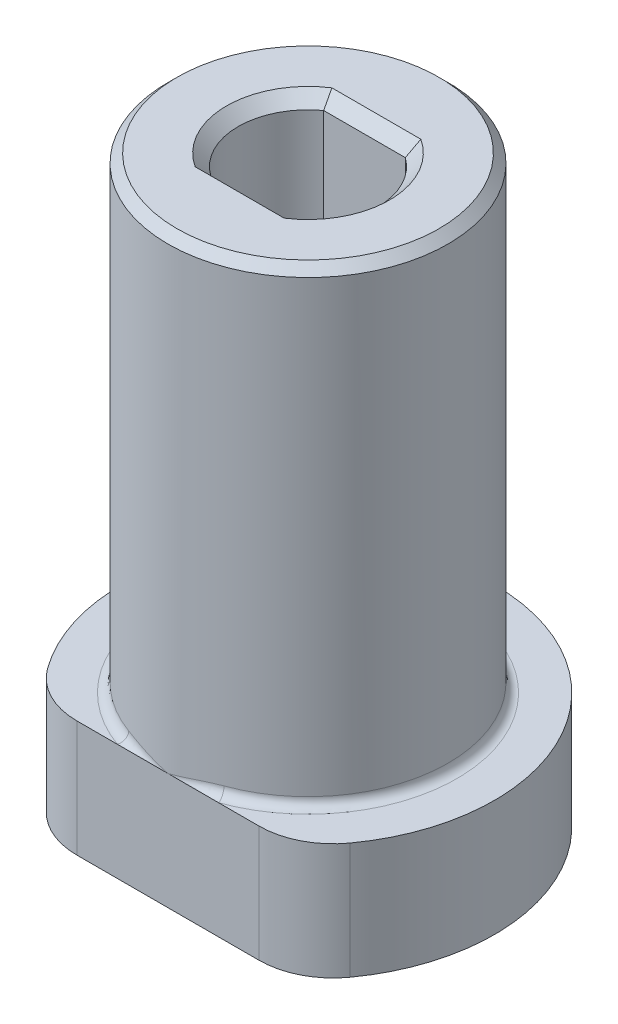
ISO-10303-21;
HEADER;
FILE_DESCRIPTION(('STEP AP214'),'2;1');
FILE_NAME('part.step','',(''),(''),'','','');
FILE_SCHEMA(('AUTOMOTIVE_DESIGN { 1 0 10303 214 1 1 1 1 }'));
ENDSEC;
DATA;
#1=APPLICATION_CONTEXT('core data for automotive mechanical design processes');
#2=APPLICATION_PROTOCOL_DEFINITION('international standard','automotive_design',2000,#1);
#3=PRODUCT_CONTEXT('',#1,'mechanical');
#4=PRODUCT('Part','Part','',(#3));
#5=PRODUCT_RELATED_PRODUCT_CATEGORY('part','',(#4));
#6=PRODUCT_DEFINITION_FORMATION('','',#4);
#7=PRODUCT_DEFINITION_CONTEXT('part definition',#1,'design');
#8=PRODUCT_DEFINITION('design','',#6,#7);
#9=PRODUCT_DEFINITION_SHAPE('','',#8);
#10=(LENGTH_UNIT() NAMED_UNIT(*) SI_UNIT(.MILLI.,.METRE.));
#11=(NAMED_UNIT(*) PLANE_ANGLE_UNIT() SI_UNIT($,.RADIAN.));
#12=(NAMED_UNIT(*) SI_UNIT($,.STERADIAN.) SOLID_ANGLE_UNIT());
#13=UNCERTAINTY_MEASURE_WITH_UNIT(LENGTH_MEASURE(1.E-05),#10,'distance_accuracy_value','');
#14=(GEOMETRIC_REPRESENTATION_CONTEXT(3) GLOBAL_UNCERTAINTY_ASSIGNED_CONTEXT((#13)) GLOBAL_UNIT_ASSIGNED_CONTEXT((#10,
#11,#12)) REPRESENTATION_CONTEXT('',''));
#15=CARTESIAN_POINT('',(0.,0.,0.));
#16=DIRECTION('',(0.,0.,1.));
#17=DIRECTION('',(1.,0.,0.));
#18=AXIS2_PLACEMENT_3D('',#15,#16,#17);
#19=CARTESIAN_POINT('',(0.,24.9936,0.));
#20=DIRECTION('',(0.,-1.,0.));
#21=DIRECTION('',(0.,0.,-1.));
#22=AXIS2_PLACEMENT_3D('',#19,#20,#21);
#23=CYLINDRICAL_SURFACE('',#22,5.99567);
#24=CARTESIAN_POINT('',(0.,24.6126,0.));
#25=DIRECTION('',(0.,1.,0.));
#26=DIRECTION('',(0.,0.,1.));
#27=AXIS2_PLACEMENT_3D('',#24,#25,#26);
#28=CIRCLE('',#27,5.99567);
#29=CARTESIAN_POINT('',(0.,24.6126,5.99567));
#30=VERTEX_POINT('',#29);
#31=EDGE_CURVE('E12',#30,#30,#28,.F.);
#32=ORIENTED_EDGE('',*,*,#31,.T.);
#33=EDGE_LOOP('',(#32));
#34=FACE_BOUND('',#33,.T.);
#35=CARTESIAN_POINT('',(-2.54980318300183,5.28632587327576,5.42646869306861));
#36=CARTESIAN_POINT('',(-2.48955629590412,5.07151106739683,5.4547776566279));
#37=CARTESIAN_POINT('',(-2.54417708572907,4.96770798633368,5.64665776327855));
#38=CARTESIAN_POINT('',(-2.59879787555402,4.86390490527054,5.8385378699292));
#39=CARTESIAN_POINT('',(-2.71183261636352,4.9784,5.99567));
#40=CARTESIAN_POINT('',(-2.5328324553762,5.29249967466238,5.43444335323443));
#41=CARTESIAN_POINT('',(-2.47686708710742,5.07926238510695,5.46051204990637));
#42=CARTESIAN_POINT('',(-2.53071149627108,4.97410558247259,5.64842878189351));
#43=CARTESIAN_POINT('',(-2.58464892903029,4.86890599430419,5.83633151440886));
#44=CARTESIAN_POINT('',(-2.69378346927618,4.9784,5.99567));
#45=CARTESIAN_POINT('',(-2.51569041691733,5.29813682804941,5.44240047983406));
#46=CARTESIAN_POINT('',(-2.46357302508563,5.08665837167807,5.46647827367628));
#47=CARTESIAN_POINT('',(-2.51670710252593,4.98030571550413,5.65053281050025));
#48=CARTESIAN_POINT('',(-2.56993249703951,4.8739154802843,5.83457198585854));
#49=CARTESIAN_POINT('',(-2.67555212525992,4.9784,5.99567));
#50=CARTESIAN_POINT('',(-2.48113264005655,5.30845859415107,5.45824144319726));
#51=CARTESIAN_POINT('',(-2.43607242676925,5.100688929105,5.47871075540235));
#52=CARTESIAN_POINT('',(-2.48782417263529,4.99226856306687,5.65527019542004));
#53=CARTESIAN_POINT('',(-2.53966544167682,4.88381087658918,5.83181533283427));
#54=CARTESIAN_POINT('',(-2.6387983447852,4.9784,5.99567));
#55=CARTESIAN_POINT('',(-2.46371706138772,5.31314374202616,5.46612531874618));
#56=CARTESIAN_POINT('',(-2.42186664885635,5.10733143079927,5.48497739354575));
#57=CARTESIAN_POINT('',(-2.47294613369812,4.99803152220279,5.65790325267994));
#58=CARTESIAN_POINT('',(-2.5241145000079,4.88869957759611,5.8308124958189));
#59=CARTESIAN_POINT('',(-2.62027607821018,4.9784,5.99567));
#60=CARTESIAN_POINT('',(-2.41122128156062,5.32594031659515,5.48958438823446));
#61=CARTESIAN_POINT('',(-2.3783667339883,5.12606545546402,5.50396956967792));
#62=CARTESIAN_POINT('',(-2.42735814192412,5.01458404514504,5.66638077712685));
#63=CARTESIAN_POINT('',(-2.47670012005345,4.90297487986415,5.82872696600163));
#64=CARTESIAN_POINT('',(-2.56444440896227,4.9784,5.99567));
#65=CARTESIAN_POINT('',(-2.37580723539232,5.33282227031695,5.50500692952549));
#66=CARTESIAN_POINT('',(-2.34786612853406,5.13714882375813,5.51703440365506));
#67=CARTESIAN_POINT('',(-2.39562554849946,5.02466938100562,5.67281373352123));
#68=CARTESIAN_POINT('',(-2.44371625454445,4.91209679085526,5.82852360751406));
#69=CARTESIAN_POINT('',(-2.52677994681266,4.9784,5.99567));
#70=CARTESIAN_POINT('',(-2.3046909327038,5.34393123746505,5.53515484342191));
#71=CARTESIAN_POINT('',(-2.28523912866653,5.15660519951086,5.5432215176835));
#72=CARTESIAN_POINT('',(-2.33063959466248,5.04291464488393,5.68651191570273));
#73=CARTESIAN_POINT('',(-2.37636397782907,4.92913328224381,5.82973366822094));
#74=CARTESIAN_POINT('',(-2.45114449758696,4.9784,5.99567));
#75=CARTESIAN_POINT('',(-2.26899348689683,5.34817975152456,5.54988492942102));
#76=CARTESIAN_POINT('',(-2.25311326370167,5.16503612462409,5.55635481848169));
#77=CARTESIAN_POINT('',(-2.29740099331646,5.0510898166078,5.69376981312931));
#78=CARTESIAN_POINT('',(-2.34198956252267,4.93707751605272,5.83111843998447));
#79=CARTESIAN_POINT('',(-2.41317862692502,4.9784,5.99567));
#80=CARTESIAN_POINT('',(-2.19715327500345,5.35457227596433,5.57871642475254));
#81=CARTESIAN_POINT('',(-2.18751899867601,5.17966637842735,5.58248690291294));
#82=CARTESIAN_POINT('',(-2.22964656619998,5.06578154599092,5.70876275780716));
#83=CARTESIAN_POINT('',(-2.27207244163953,4.95183278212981,5.83497240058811));
#84=CARTESIAN_POINT('',(-2.33677326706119,4.9784,5.99567));
#85=CARTESIAN_POINT('',(-2.16101016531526,5.35671454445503,5.59281730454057));
#86=CARTESIAN_POINT('',(-2.15402920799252,5.18589061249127,5.5954995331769));
#87=CARTESIAN_POINT('',(-2.19512970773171,5.07229672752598,5.71649819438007));
#88=CARTESIAN_POINT('',(-2.23650484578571,4.95866004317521,5.83743484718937));
#89=CARTESIAN_POINT('',(-2.29833341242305,4.9784,5.99567));
#90=CARTESIAN_POINT('',(-2.04046740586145,5.36092875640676,5.63849773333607));
#91=CARTESIAN_POINT('',(-2.04181783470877,5.20326472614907,5.63790197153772));
#92=CARTESIAN_POINT('',(-2.07900805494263,5.0914555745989,5.74248386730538));
#93=CARTESIAN_POINT('',(-2.11766521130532,4.97939863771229,5.84673875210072));
#94=CARTESIAN_POINT('',(-2.17013065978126,4.9784,5.99567));
#95=CARTESIAN_POINT('',(-1.9553715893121,5.35917193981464,5.66856856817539));
#96=CARTESIAN_POINT('',(-1.96023898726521,5.2104399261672,5.66685144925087));
#97=CARTESIAN_POINT('',(-1.99541430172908,5.10083051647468,5.7611298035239));
#98=CARTESIAN_POINT('',(-2.03179053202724,4.99112639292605,5.85515357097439));
#99=CARTESIAN_POINT('',(-2.07962735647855,4.9784,5.99567));
#100=CARTESIAN_POINT('',(-1.78423205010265,5.34914327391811,5.72474524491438));
#101=CARTESIAN_POINT('',(-1.79446551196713,5.21723388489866,5.72150414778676));
#102=CARTESIAN_POINT('',(-1.82561253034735,5.11346703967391,5.79744405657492));
#103=CARTESIAN_POINT('',(-1.85794408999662,5.00961731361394,5.87312842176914));
#104=CARTESIAN_POINT('',(-1.89761260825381,4.9784,5.99567));
#105=CARTESIAN_POINT('',(-1.69818768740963,5.34086672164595,5.75084820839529));
#106=CARTESIAN_POINT('',(-1.71004175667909,5.21696289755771,5.74733698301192));
#107=CARTESIAN_POINT('',(-1.73940266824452,5.11672420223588,5.81511165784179));
#108=CARTESIAN_POINT('',(-1.76972353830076,5.0164752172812,5.8827019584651));
#109=CARTESIAN_POINT('',(-1.80610048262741,4.9784,5.99567));
#110=CARTESIAN_POINT('',(-1.52486291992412,5.3194781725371,5.79922452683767));
#111=CARTESIAN_POINT('',(-1.53899766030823,5.21085838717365,5.79548128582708));
#112=CARTESIAN_POINT('',(-1.56472719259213,5.11858987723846,5.8486920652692));
#113=CARTESIAN_POINT('',(-1.59141922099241,5.02631112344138,5.90171763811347));
#114=CARTESIAN_POINT('',(-1.62176164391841,4.9784,5.99567));
#115=CARTESIAN_POINT('',(-1.43757808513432,5.30633034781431,5.82146766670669));
#116=CARTESIAN_POINT('',(-1.45215982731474,5.20503639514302,5.81786853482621));
#117=CARTESIAN_POINT('',(-1.47624950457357,5.11716331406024,5.86459070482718));
#118=CARTESIAN_POINT('',(-1.50110723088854,5.02931572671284,5.9111852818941));
#119=CARTESIAN_POINT('',(-1.52893021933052,4.9784,5.99567));
#120=CARTESIAN_POINT('',(-1.26259961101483,5.27647534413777,5.86190836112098));
#121=CARTESIAN_POINT('',(-1.27748293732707,5.1892434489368,5.85869577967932));
#122=CARTESIAN_POINT('',(-1.2982326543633,5.11072673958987,5.89397088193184));
#123=CARTESIAN_POINT('',(-1.31974036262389,5.03223969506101,5.9291217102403));
#124=CARTESIAN_POINT('',(-1.34283258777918,4.9784,5.99567));
#125=CARTESIAN_POINT('',(-1.17490584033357,5.25976693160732,5.88010450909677));
#126=CARTESIAN_POINT('',(-1.18946797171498,5.17928971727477,5.87721102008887));
#127=CARTESIAN_POINT('',(-1.20869313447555,5.10571548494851,5.90745157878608));
#128=CARTESIAN_POINT('',(-1.22850041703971,5.03218732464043,5.93761755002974));
#129=CARTESIAN_POINT('',(-1.24956624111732,4.9784,5.99567));
#130=CARTESIAN_POINT('',(-0.908724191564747,5.20522505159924,5.92917990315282));
#131=CARTESIAN_POINT('',(-0.922706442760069,5.14468503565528,5.92702174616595));
#132=CARTESIAN_POINT('',(-0.936283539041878,5.08652119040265,5.94417451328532));
#133=CARTESIAN_POINT('',(-0.952273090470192,5.02851716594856,5.96099424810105));
#134=CARTESIAN_POINT('',(-0.966469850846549,4.9784,5.99567));
#135=CARTESIAN_POINT('',(-0.729793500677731,5.16336476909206,5.95380718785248));
#136=CARTESIAN_POINT('',(-0.741135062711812,5.11520633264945,5.95250259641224));
#137=CARTESIAN_POINT('',(-0.752316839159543,5.06820817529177,5.96316129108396));
#138=CARTESIAN_POINT('',(-0.764671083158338,5.02132925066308,5.97373619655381));
#139=CARTESIAN_POINT('',(-0.776168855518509,4.9784,5.99567));
#140=CARTESIAN_POINT('',(-0.372077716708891,5.07506928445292,5.98680063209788));
#141=CARTESIAN_POINT('',(-0.378529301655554,5.05098210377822,5.98646171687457));
#142=CARTESIAN_POINT('',(-0.383890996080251,5.02670159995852,5.98871246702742));
#143=CARTESIAN_POINT('',(-0.390372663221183,5.00256000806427,5.99088799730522));
#144=CARTESIAN_POINT('',(-0.395721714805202,4.9784,5.99567));
#145=CARTESIAN_POINT('',(-0.193293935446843,5.02864888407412,5.99521768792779));
#146=CARTESIAN_POINT('',(-0.196379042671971,5.0160887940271,5.99520212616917));
#147=CARTESIAN_POINT('',(-0.19943522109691,5.00352356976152,5.99531574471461));
#148=CARTESIAN_POINT('',(-0.202521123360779,4.99096203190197,5.99542787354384));
#149=CARTESIAN_POINT('',(-0.205576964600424,4.9784,5.99567));
#150=CARTESIAN_POINT('',(-0.00972468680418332,4.9809281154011,5.99566407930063));
#151=CARTESIAN_POINT('',(-0.00987918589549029,4.98029608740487,5.99566392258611));
#152=CARTESIAN_POINT('',(-0.0100336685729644,4.97966405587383,5.99566538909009));
#153=CARTESIAN_POINT('',(-0.0101881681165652,4.97903202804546,5.99566689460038));
#154=CARTESIAN_POINT('',(-0.0103426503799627,4.9784,5.99567));
#155=CARTESIAN_POINT('',(-0.0048623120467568,4.97966404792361,5.99566999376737));
#156=CARTESIAN_POINT('',(-0.00493955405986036,4.97934803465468,5.99567002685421));
#157=CARTESIAN_POINT('',(-0.00501680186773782,4.97903202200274,5.99567001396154));
#158=CARTESIAN_POINT('',(-0.00509404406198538,4.97871601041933,5.99567004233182));
#159=CARTESIAN_POINT('',(-0.00517129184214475,4.9784,5.99567));
#160=CARTESIAN_POINT('',(0.,4.9784,5.99567));
#161=CARTESIAN_POINT('',(0.,4.9784,5.99567));
#162=CARTESIAN_POINT('',(0.,4.9784,5.99567));
#163=CARTESIAN_POINT('',(0.,4.9784,5.99567));
#164=CARTESIAN_POINT('',(0.,4.9784,5.99567));
#165=(BOUNDED_SURFACE() B_SPLINE_SURFACE(3,2,((#35,#36,#37,#38,#39),(#40,#41,#42,#43,#44),(#45,
#46,#47,#48,#49),(#50,#51,#52,#53,#54),(#55,#56,#57,#58,#59),(#60,#61,#62,#63,#64),(#65,#66,#67,
#68,#69),(#70,#71,#72,#73,#74),(#75,#76,#77,#78,#79),(#80,#81,#82,#83,#84),(#85,#86,#87,#88,
#89),(#90,#91,#92,#93,#94),(#95,#96,#97,#98,#99),(#100,#101,#102,#103,#104),(#105,#106,#107,
#108,#109),(#110,#111,#112,#113,#114),(#115,#116,#117,#118,#119),(#120,#121,#122,#123,#124),
(#125,#126,#127,#128,#129),(#130,#131,#132,#133,#134),(#135,#136,#137,#138,#139),(#140,#141,
#142,#143,#144),(#145,#146,#147,#148,#149),(#150,#151,#152,#153,#154),(#155,#156,#157,#158,
#159),(#160,#161,#162,#163,#164)),.UNSPECIFIED.,.F.,.F.,.F.) B_SPLINE_SURFACE_WITH_KNOTS((4,2,2,
2,2,2,2,2,2,2,2,2,4),(3,2,3),(0.,0.0626078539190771,0.1251804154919,0.250014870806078,
0.373816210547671,0.497719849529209,0.785246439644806,1.07298062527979,1.36287450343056,
1.65286897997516,2.24168937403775,2.82865797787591,2.84462879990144),(0.,0.5,1.),
.UNSPECIFIED.) GEOMETRIC_REPRESENTATION_ITEM() RATIONAL_B_SPLINE_SURFACE(((1.,0.861168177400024,
1.,0.861168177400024,1.),(1.,0.864075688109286,1.,0.864075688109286,1.),(1.,0.86688678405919,1.,
0.86688678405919,1.),(1.,0.8723313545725,1.,0.8723313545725,1.),(1.,0.874964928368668,1.,
0.874964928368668,1.),(1.,0.882614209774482,1.,0.882614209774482,1.),(1.,0.887392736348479,1.,
0.887392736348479,1.),(1.,0.896384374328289,1.,0.896384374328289,1.),(1.,0.900601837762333,1.,
0.900601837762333,1.),(1.,0.908601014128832,1.,0.908601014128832,1.),(1.,0.912382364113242,1.,
0.912382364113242,1.),(1.,0.924319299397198,1.,0.924319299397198,1.),(1.,0.931657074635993,1.,
0.931657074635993,1.),(1.,0.944837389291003,1.,0.944837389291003,1.),(1.,0.950678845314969,1.,
0.950678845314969,1.),(1.,0.961199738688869,1.,0.961199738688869,1.),(1.,0.965870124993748,1.,
0.965870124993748,1.),(1.,0.974185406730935,1.,0.974185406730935,1.),(1.,0.977829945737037,1.,
0.977829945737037,1.),(1.,0.987522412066,1.,0.987522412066,1.),(1.,0.992177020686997,1.,
0.992177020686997,1.),(1.,0.99836924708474,1.,0.99836924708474,1.),(1.,0.999916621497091,1.,
0.999916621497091,1.),(1.,0.999998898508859,1.,0.999998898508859,1.),(1.,0.999999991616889,1.,
0.999999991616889,1.),(1.,1.,1.,1.,1.))) REPRESENTATION_ITEM('') SURFACE());
#166=CARTESIAN_POINT('',(-2.54980318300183,5.28632587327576,5.42646869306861));
#167=CARTESIAN_POINT('',(-2.5328324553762,5.29249967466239,5.43444335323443));
#168=CARTESIAN_POINT('',(-2.51569041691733,5.29813682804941,5.44240047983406));
#169=CARTESIAN_POINT('',(-2.48113264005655,5.30845859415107,5.45824144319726));
#170=CARTESIAN_POINT('',(-2.46371706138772,5.31314374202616,5.46612531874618));
#171=CARTESIAN_POINT('',(-2.41122128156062,5.32594031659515,5.48958438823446));
#172=CARTESIAN_POINT('',(-2.37580723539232,5.33282227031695,5.50500692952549));
#173=CARTESIAN_POINT('',(-2.3046909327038,5.34393123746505,5.53515484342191));
#174=CARTESIAN_POINT('',(-2.26899348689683,5.34817975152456,5.54988492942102));
#175=CARTESIAN_POINT('',(-2.19715327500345,5.35457227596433,5.57871642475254));
#176=CARTESIAN_POINT('',(-2.16101016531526,5.35671454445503,5.59281730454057));
#177=CARTESIAN_POINT('',(-2.04046740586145,5.36092875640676,5.63849773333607));
#178=CARTESIAN_POINT('',(-1.9553715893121,5.35917193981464,5.66856856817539));
#179=CARTESIAN_POINT('',(-1.78423205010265,5.34914327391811,5.72474524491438));
#180=CARTESIAN_POINT('',(-1.69818768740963,5.34086672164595,5.75084820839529));
#181=CARTESIAN_POINT('',(-1.52486291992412,5.3194781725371,5.79922452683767));
#182=CARTESIAN_POINT('',(-1.43757808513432,5.30633034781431,5.82146766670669));
#183=CARTESIAN_POINT('',(-1.26259961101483,5.27647534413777,5.86190836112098));
#184=CARTESIAN_POINT('',(-1.17490584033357,5.25976693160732,5.88010450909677));
#185=CARTESIAN_POINT('',(-0.908724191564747,5.20522505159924,5.92917990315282));
#186=CARTESIAN_POINT('',(-0.729793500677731,5.16336476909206,5.95380718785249));
#187=CARTESIAN_POINT('',(-0.37207771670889,5.07506928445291,5.98680063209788));
#188=CARTESIAN_POINT('',(-0.193293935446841,5.02864888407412,5.99521768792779));
#189=CARTESIAN_POINT('',(-0.00972468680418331,4.9809281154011,5.99566407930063));
#190=CARTESIAN_POINT('',(-0.0048623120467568,4.97966404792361,5.99566999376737));
#191=CARTESIAN_POINT('',(0.,4.9784,5.99567));
#192=B_SPLINE_CURVE_WITH_KNOTS('',3,(#166,#167,#168,#169,#170,#171,#172,#173,#174,#175,#176,
#177,#178,#179,#180,#181,#182,#183,#184,#185,#186,#187,#188,#189,#190,#191),.UNSPECIFIED.,.F.,
.F.,(4,2,2,2,2,2,2,2,2,2,2,2,4),(0.,0.0626078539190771,0.1251804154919,0.250014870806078,
0.373816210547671,0.497719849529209,0.785246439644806,1.07298062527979,1.36287450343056,
1.65286897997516,2.24168937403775,2.82865797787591,2.84462879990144),.UNSPECIFIED.);
#193=CARTESIAN_POINT('',(-2.04141917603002,5.3594,5.63743438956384));
#194=VERTEX_POINT('',#193);
#195=CARTESIAN_POINT('',(0.,4.9784,5.99567));
#196=VERTEX_POINT('',#195);
#197=EDGE_CURVE('E140',#194,#196,#192,.T.);
#198=ORIENTED_EDGE('',*,*,#197,.T.);
#199=CARTESIAN_POINT('',(2.7118326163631,4.9784,5.99567));
#200=CARTESIAN_POINT('',(2.59879787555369,4.86390490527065,5.83853786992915));
#201=CARTESIAN_POINT('',(2.54417708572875,4.96770798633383,5.64665776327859));
#202=CARTESIAN_POINT('',(2.48955629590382,5.07151106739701,5.45477765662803));
#203=CARTESIAN_POINT('',(2.54980318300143,5.2863258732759,5.4264686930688));
#204=CARTESIAN_POINT('',(2.69378346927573,4.9784,5.99567));
#205=CARTESIAN_POINT('',(2.58464892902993,4.86890599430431,5.83633151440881));
#206=CARTESIAN_POINT('',(2.53071149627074,4.97410558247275,5.64842878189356));
#207=CARTESIAN_POINT('',(2.4768670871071,5.07926238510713,5.46051204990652));
#208=CARTESIAN_POINT('',(2.53283245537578,5.29249967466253,5.43444335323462));
#209=CARTESIAN_POINT('',(2.67555212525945,4.9784,5.99567));
#210=CARTESIAN_POINT('',(2.56993249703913,4.87391548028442,5.8345719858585));
#211=CARTESIAN_POINT('',(2.51670710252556,4.98030571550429,5.65053281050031));
#212=CARTESIAN_POINT('',(2.46357302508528,5.08665837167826,5.46647827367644));
#213=CARTESIAN_POINT('',(2.51569041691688,5.29813682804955,5.44240047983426));
#214=CARTESIAN_POINT('',(2.63879834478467,4.9784,5.99567));
#215=CARTESIAN_POINT('',(2.53966544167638,4.88381087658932,5.83181533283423));
#216=CARTESIAN_POINT('',(2.48782417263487,4.99226856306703,5.65527019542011));
#217=CARTESIAN_POINT('',(2.43607242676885,5.10068892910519,5.47871075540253));
#218=CARTESIAN_POINT('',(2.48113264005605,5.30845859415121,5.45824144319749));
#219=CARTESIAN_POINT('',(2.62027607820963,4.9784,5.99567));
#220=CARTESIAN_POINT('',(2.52411450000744,4.88869957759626,5.83081249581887));
#221=CARTESIAN_POINT('',(2.47294613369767,4.99803152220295,5.65790325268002));
#222=CARTESIAN_POINT('',(2.42186664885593,5.10733143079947,5.48497739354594));
#223=CARTESIAN_POINT('',(2.4637170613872,5.31314374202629,5.46612531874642));
#224=CARTESIAN_POINT('',(2.56444440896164,4.9784,5.99567));
#225=CARTESIAN_POINT('',(2.47670012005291,4.90297487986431,5.82872696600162));
#226=CARTESIAN_POINT('',(2.4273581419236,5.01458404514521,5.66638077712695));
#227=CARTESIAN_POINT('',(2.3783667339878,5.12606545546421,5.50396956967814));
#228=CARTESIAN_POINT('',(2.41122128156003,5.32594031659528,5.48958438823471));
#229=CARTESIAN_POINT('',(2.52677994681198,4.9784,5.99567));
#230=CARTESIAN_POINT('',(2.44371625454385,4.91209679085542,5.82852360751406));
#231=CARTESIAN_POINT('',(2.39562554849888,5.0246693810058,5.67281373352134));
#232=CARTESIAN_POINT('',(2.3478661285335,5.13714882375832,5.5170344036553));
#233=CARTESIAN_POINT('',(2.37580723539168,5.33282227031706,5.50500692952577));
#234=CARTESIAN_POINT('',(2.45114449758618,4.9784,5.99567));
#235=CARTESIAN_POINT('',(2.37636397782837,4.92913328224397,5.82973366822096));
#236=CARTESIAN_POINT('',(2.3306395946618,5.0429146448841,5.68651191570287));
#237=CARTESIAN_POINT('',(2.28523912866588,5.15660519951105,5.54322151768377));
#238=CARTESIAN_POINT('',(2.30469093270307,5.34393123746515,5.53515484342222));
#239=CARTESIAN_POINT('',(2.41317862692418,4.9784,5.99567));
#240=CARTESIAN_POINT('',(2.34198956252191,4.9370775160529,5.8311184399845));
#241=CARTESIAN_POINT('',(2.29740099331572,5.05108981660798,5.69376981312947));
#242=CARTESIAN_POINT('',(2.25311326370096,5.16503612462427,5.55635481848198));
#243=CARTESIAN_POINT('',(2.26899348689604,5.34817975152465,5.54988492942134));
#244=CARTESIAN_POINT('',(2.33677326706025,4.9784,5.99567));
#245=CARTESIAN_POINT('',(2.27207244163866,4.95183278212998,5.83497240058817));
#246=CARTESIAN_POINT('',(2.22964656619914,5.06578154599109,5.70876275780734));
#247=CARTESIAN_POINT('',(2.1875189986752,5.17966637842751,5.58248690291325));
#248=CARTESIAN_POINT('',(2.19715327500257,5.35457227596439,5.57871642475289));
#249=CARTESIAN_POINT('',(2.29833341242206,4.9784,5.99567));
#250=CARTESIAN_POINT('',(2.23650484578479,4.95866004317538,5.83743484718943));
#251=CARTESIAN_POINT('',(2.19512970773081,5.07229672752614,5.71649819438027));
#252=CARTESIAN_POINT('',(2.15402920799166,5.18589061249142,5.59549953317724));
#253=CARTESIAN_POINT('',(2.16101016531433,5.35671454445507,5.59281730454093));
#254=CARTESIAN_POINT('',(2.1701306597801,4.9784,5.99567));
#255=CARTESIAN_POINT('',(2.11766521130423,4.97939863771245,5.84673875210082));
#256=CARTESIAN_POINT('',(2.07900805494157,5.09145557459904,5.74248386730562));
#257=CARTESIAN_POINT('',(2.04181783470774,5.20326472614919,5.6379019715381));
#258=CARTESIAN_POINT('',(2.04046740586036,5.36092875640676,5.63849773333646));
#259=CARTESIAN_POINT('',(2.07962735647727,4.9784,5.99567));
#260=CARTESIAN_POINT('',(2.03179053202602,4.9911263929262,5.85515357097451));
#261=CARTESIAN_POINT('',(1.99541430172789,5.1008305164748,5.76112980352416));
#262=CARTESIAN_POINT('',(1.96023898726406,5.21043992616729,5.66685144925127));
#263=CARTESIAN_POINT('',(1.9553715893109,5.35917193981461,5.6685685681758));
#264=CARTESIAN_POINT('',(1.89761260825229,4.9784,5.99567));
#265=CARTESIAN_POINT('',(1.85794408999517,5.00961731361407,5.87312842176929));
#266=CARTESIAN_POINT('',(1.82561253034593,5.11346703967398,5.79744405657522));
#267=CARTESIAN_POINT('',(1.79446551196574,5.21723388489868,5.72150414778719));
#268=CARTESIAN_POINT('',(1.78423205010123,5.349143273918,5.72474524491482));
#269=CARTESIAN_POINT('',(1.80610048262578,4.9784,5.99567));
#270=CARTESIAN_POINT('',(1.76972353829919,5.01647521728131,5.88270195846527));
#271=CARTESIAN_POINT('',(1.73940266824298,5.11672420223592,5.8151116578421));
#272=CARTESIAN_POINT('',(1.71004175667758,5.21696289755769,5.74733698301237));
#273=CARTESIAN_POINT('',(1.6981876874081,5.34086672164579,5.75084820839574));
#274=CARTESIAN_POINT('',(1.62176164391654,4.9784,5.99567));
#275=CARTESIAN_POINT('',(1.5914192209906,5.02631112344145,5.90171763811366));
#276=CARTESIAN_POINT('',(1.56472719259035,5.11858987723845,5.84869206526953));
#277=CARTESIAN_POINT('',(1.5389976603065,5.21085838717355,5.79548128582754));
#278=CARTESIAN_POINT('',(1.52486291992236,5.31947817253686,5.79922452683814));
#279=CARTESIAN_POINT('',(1.52893021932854,4.9784,5.99567));
#280=CARTESIAN_POINT('',(1.50110723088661,5.02931572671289,5.9111852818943));
#281=CARTESIAN_POINT('',(1.47624950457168,5.1171633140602,5.86459070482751));
#282=CARTESIAN_POINT('',(1.45215982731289,5.20503639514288,5.81786853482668));
#283=CARTESIAN_POINT('',(1.43757808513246,5.30633034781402,5.82146766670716));
#284=CARTESIAN_POINT('',(1.34283258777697,4.9784,5.99567));
#285=CARTESIAN_POINT('',(1.31974036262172,5.03223969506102,5.9291217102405));
#286=CARTESIAN_POINT('',(1.29823265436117,5.11072673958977,5.89397088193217));
#287=CARTESIAN_POINT('',(1.27748293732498,5.18924344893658,5.85869577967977));
#288=CARTESIAN_POINT('',(1.26259961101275,5.27647534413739,5.86190836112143));
#289=CARTESIAN_POINT('',(1.24956624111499,4.9784,5.99567));
#290=CARTESIAN_POINT('',(1.22850041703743,5.03218732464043,5.93761755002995));
#291=CARTESIAN_POINT('',(1.20869313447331,5.10571548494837,5.9074515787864));
#292=CARTESIAN_POINT('',(1.18946797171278,5.17928971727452,5.87721102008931));
#293=CARTESIAN_POINT('',(1.17490584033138,5.25976693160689,5.88010450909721));
#294=CARTESIAN_POINT('',(0.966469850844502,4.9784,5.99567));
#295=CARTESIAN_POINT('',(0.952273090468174,5.0285171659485,5.9609942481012));
#296=CARTESIAN_POINT('',(0.9362835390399,5.08652119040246,5.94417451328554));
#297=CARTESIAN_POINT('',(0.922706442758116,5.14468503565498,5.92702174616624));
#298=CARTESIAN_POINT('',(0.908724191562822,5.2052250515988,5.9291799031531));
#299=CARTESIAN_POINT('',(0.776168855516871,4.9784,5.99567));
#300=CARTESIAN_POINT('',(0.764671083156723,5.02132925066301,5.97373619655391));
#301=CARTESIAN_POINT('',(0.752316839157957,5.0682081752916,5.9631612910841));
#302=CARTESIAN_POINT('',(0.741135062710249,5.11520633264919,5.95250259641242));
#303=CARTESIAN_POINT('',(0.72979350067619,5.1633647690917,5.95380718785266));
#304=CARTESIAN_POINT('',(0.39572171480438,4.9784,5.99567));
#305=CARTESIAN_POINT('',(0.390372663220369,5.00256000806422,5.99088799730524));
#306=CARTESIAN_POINT('',(0.383890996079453,5.02670159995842,5.98871246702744));
#307=CARTESIAN_POINT('',(0.378529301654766,5.05098210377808,5.98646171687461));
#308=CARTESIAN_POINT('',(0.372077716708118,5.07506928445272,5.98680063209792));
#309=CARTESIAN_POINT('',(0.205576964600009,4.9784,5.99567));
#310=CARTESIAN_POINT('',(0.20252112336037,4.99096203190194,5.99542787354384));
#311=CARTESIAN_POINT('',(0.199435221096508,5.00352356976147,5.99531574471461));
#312=CARTESIAN_POINT('',(0.196379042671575,5.01608879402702,5.99520212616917));
#313=CARTESIAN_POINT('',(0.193293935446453,5.02864888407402,5.99521768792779));
#314=CARTESIAN_POINT('',(0.0103426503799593,4.9784,5.99567));
#315=CARTESIAN_POINT('',(0.0101881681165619,4.97903202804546,5.99566689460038));
#316=CARTESIAN_POINT('',(0.010033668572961,4.97966405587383,5.99566538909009));
#317=CARTESIAN_POINT('',(0.0098791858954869,4.98029608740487,5.99566392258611));
#318=CARTESIAN_POINT('',(0.00972468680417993,4.9809281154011,5.99566407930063));
#319=CARTESIAN_POINT('',(0.00517129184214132,4.9784,5.99567));
#320=CARTESIAN_POINT('',(0.00509404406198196,4.97871601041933,5.99567004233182));
#321=CARTESIAN_POINT('',(0.00501680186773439,4.97903202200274,5.99567001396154));
#322=CARTESIAN_POINT('',(0.00493955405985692,4.97934803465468,5.99567002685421));
#323=CARTESIAN_POINT('',(0.00486231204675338,4.97966404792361,5.99566999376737));
#324=CARTESIAN_POINT('',(0.,4.9784,5.99567));
#325=CARTESIAN_POINT('',(0.,4.9784,5.99567));
#326=CARTESIAN_POINT('',(0.,4.9784,5.99567));
#327=CARTESIAN_POINT('',(0.,4.9784,5.99567));
#328=CARTESIAN_POINT('',(0.,4.9784,5.99567));
#329=(BOUNDED_SURFACE() B_SPLINE_SURFACE(3,2,((#199,#200,#201,#202,#203),(#204,#205,#206,#207,
#208),(#209,#210,#211,#212,#213),(#214,#215,#216,#217,#218),(#219,#220,#221,#222,#223),(#224,
#225,#226,#227,#228),(#229,#230,#231,#232,#233),(#234,#235,#236,#237,#238),(#239,#240,#241,#242,
#243),(#244,#245,#246,#247,#248),(#249,#250,#251,#252,#253),(#254,#255,#256,#257,#258),(#259,
#260,#261,#262,#263),(#264,#265,#266,#267,#268),(#269,#270,#271,#272,#273),(#274,#275,#276,#277,
#278),(#279,#280,#281,#282,#283),(#284,#285,#286,#287,#288),(#289,#290,#291,#292,#293),(#294,
#295,#296,#297,#298),(#299,#300,#301,#302,#303),(#304,#305,#306,#307,#308),(#309,#310,#311,#312,
#313),(#314,#315,#316,#317,#318),(#319,#320,#321,#322,#323),(#324,#325,#326,#327,#328)),
.UNSPECIFIED.,.F.,.F.,.F.) B_SPLINE_SURFACE_WITH_KNOTS((4,2,2,2,2,2,2,2,2,2,2,2,4),(3,2,3),(0.,
0.0626078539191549,0.125180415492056,0.25001487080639,0.373816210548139,0.497719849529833,
0.785246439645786,1.07298062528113,1.36287450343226,1.65286897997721,2.24168937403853,
2.82865797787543,2.84462879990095),(0.,0.5,1.),
.UNSPECIFIED.) GEOMETRIC_REPRESENTATION_ITEM() RATIONAL_B_SPLINE_SURFACE(((1.,0.861168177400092,
1.,0.861168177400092,1.),(1.,0.864075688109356,1.,0.864075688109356,1.),(1.,0.866886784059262,
1.,0.866886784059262,1.),(1.,0.872331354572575,1.,0.872331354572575,1.),(1.,0.874964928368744,
1.,0.874964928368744,1.),(1.,0.882614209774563,1.,0.882614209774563,1.),(1.,0.887392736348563,
1.,0.887392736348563,1.),(1.,0.896384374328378,1.,0.896384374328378,1.),(1.,0.900601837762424,
1.,0.900601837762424,1.),(1.,0.908601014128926,1.,0.908601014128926,1.),(1.,0.912382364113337,
1.,0.912382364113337,1.),(1.,0.924319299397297,1.,0.924319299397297,1.),(1.,0.931657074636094,
1.,0.931657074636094,1.),(1.,0.944837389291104,1.,0.944837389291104,1.),(1.,0.950678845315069,
1.,0.950678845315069,1.),(1.,0.961199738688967,1.,0.961199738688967,1.),(1.,0.965870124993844,
1.,0.965870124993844,1.),(1.,0.974185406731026,1.,0.974185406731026,1.),(1.,0.977829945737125,
1.,0.977829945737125,1.),(1.,0.987522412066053,1.,0.987522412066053,1.),(1.,0.99217702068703,1.,
0.99217702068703,1.),(1.,0.998369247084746,1.,0.998369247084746,1.),(1.,0.999916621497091,1.,
0.999916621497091,1.),(1.,0.999998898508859,1.,0.999998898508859,1.),(1.,0.999999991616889,1.,
0.999999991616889,1.),(1.,1.,1.,1.,1.))) REPRESENTATION_ITEM('') SURFACE());
#330=CARTESIAN_POINT('',(2.54980318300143,5.2863258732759,5.4264686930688));
#331=CARTESIAN_POINT('',(2.53283245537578,5.29249967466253,5.43444335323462));
#332=CARTESIAN_POINT('',(2.51569041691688,5.29813682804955,5.44240047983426));
#333=CARTESIAN_POINT('',(2.48113264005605,5.30845859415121,5.45824144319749));
#334=CARTESIAN_POINT('',(2.4637170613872,5.31314374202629,5.46612531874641));
#335=CARTESIAN_POINT('',(2.41122128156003,5.32594031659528,5.48958438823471));
#336=CARTESIAN_POINT('',(2.37580723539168,5.33282227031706,5.50500692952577));
#337=CARTESIAN_POINT('',(2.30469093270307,5.34393123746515,5.53515484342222));
#338=CARTESIAN_POINT('',(2.26899348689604,5.34817975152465,5.54988492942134));
#339=CARTESIAN_POINT('',(2.19715327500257,5.35457227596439,5.57871642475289));
#340=CARTESIAN_POINT('',(2.16101016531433,5.35671454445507,5.59281730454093));
#341=CARTESIAN_POINT('',(2.04046740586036,5.36092875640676,5.63849773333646));
#342=CARTESIAN_POINT('',(1.9553715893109,5.35917193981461,5.6685685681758));
#343=CARTESIAN_POINT('',(1.78423205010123,5.34914327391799,5.72474524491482));
#344=CARTESIAN_POINT('',(1.6981876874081,5.34086672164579,5.75084820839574));
#345=CARTESIAN_POINT('',(1.52486291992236,5.31947817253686,5.79922452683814));
#346=CARTESIAN_POINT('',(1.43757808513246,5.30633034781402,5.82146766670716));
#347=CARTESIAN_POINT('',(1.26259961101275,5.27647534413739,5.86190836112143));
#348=CARTESIAN_POINT('',(1.17490584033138,5.25976693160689,5.88010450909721));
#349=CARTESIAN_POINT('',(0.908724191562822,5.2052250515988,5.9291799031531));
#350=CARTESIAN_POINT('',(0.729793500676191,5.1633647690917,5.95380718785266));
#351=CARTESIAN_POINT('',(0.372077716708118,5.07506928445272,5.98680063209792));
#352=CARTESIAN_POINT('',(0.193293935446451,5.02864888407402,5.99521768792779));
#353=CARTESIAN_POINT('',(0.00972468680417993,4.9809281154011,5.99566407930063));
#354=CARTESIAN_POINT('',(0.00486231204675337,4.97966404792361,5.99566999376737));
#355=CARTESIAN_POINT('',(0.,4.9784,5.99567));
#356=B_SPLINE_CURVE_WITH_KNOTS('',3,(#330,#331,#332,#333,#334,#335,#336,#337,#338,#339,#340,
#341,#342,#343,#344,#345,#346,#347,#348,#349,#350,#351,#352,#353,#354,#355),.UNSPECIFIED.,.F.,
.F.,(4,2,2,2,2,2,2,2,2,2,2,2,4),(0.,0.0626078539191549,0.125180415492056,0.25001487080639,
0.373816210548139,0.497719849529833,0.785246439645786,1.07298062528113,1.36287450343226,
1.65286897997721,2.24168937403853,2.82865797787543,2.84462879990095),.UNSPECIFIED.);
#357=CARTESIAN_POINT('',(2.04141917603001,5.3594,5.63743438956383));
#358=VERTEX_POINT('',#357);
#359=EDGE_CURVE('E143',#196,#358,#356,.F.);
#360=ORIENTED_EDGE('',*,*,#359,.T.);
#361=CARTESIAN_POINT('',(0.,5.3594,0.));
#362=DIRECTION('',(0.,-1.,0.));
#363=DIRECTION('',(0.,0.,-1.));
#364=AXIS2_PLACEMENT_3D('',#361,#362,#363);
#365=CIRCLE('',#364,5.99567);
#366=EDGE_CURVE('E146',#358,#194,#365,.F.);
#367=ORIENTED_EDGE('',*,*,#366,.T.);
#368=EDGE_LOOP('',(#198,#360,#367));
#369=FACE_BOUND('',#368,.T.);
#370=ADVANCED_FACE('F34',(#34,#369),#23,.T.);
#371=CARTESIAN_POINT('',(0.,24.9936,0.));
#372=DIRECTION('',(0.,1.,0.));
#373=DIRECTION('',(0.,0.,1.));
#374=AXIS2_PLACEMENT_3D('',#371,#372,#373);
#375=PLANE('',#374);
#376=CARTESIAN_POINT('',(0.,24.9936,0.));
#377=DIRECTION('',(0.,1.,0.));
#378=DIRECTION('',(0.,0.,1.));
#379=AXIS2_PLACEMENT_3D('',#376,#377,#378);
#380=CIRCLE('',#379,5.61467000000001);
#381=CARTESIAN_POINT('',(0.,24.9936,5.61467000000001));
#382=VERTEX_POINT('',#381);
#383=EDGE_CURVE('E42',#382,#382,#380,.T.);
#384=ORIENTED_EDGE('',*,*,#383,.T.);
#385=EDGE_LOOP('',(#384));
#386=FACE_BOUND('',#385,.T.);
#387=DIRECTION('',(1.,0.,0.));
#388=VECTOR('',#387,1.);
#389=CARTESIAN_POINT('',(1.74756568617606,24.9936,-2.92735000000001));
#390=LINE('',#389,#388);
#391=CARTESIAN_POINT('',(-1.9047777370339,24.9936,-2.92735000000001));
#392=VERTEX_POINT('',#391);
#393=CARTESIAN_POINT('',(1.9047777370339,24.9936,-2.92735000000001));
#394=VERTEX_POINT('',#393);
#395=EDGE_CURVE('E387',#392,#394,#390,.T.);
#396=ORIENTED_EDGE('',*,*,#395,.T.);
#397=CARTESIAN_POINT('',(0.,24.9936,0.));
#398=DIRECTION('',(0.,1.,0.));
#399=DIRECTION('',(0.,0.,1.));
#400=AXIS2_PLACEMENT_3D('',#397,#398,#399);
#401=CIRCLE('',#400,3.4925);
#402=CARTESIAN_POINT('',(1.9047777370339,24.9936,2.92735000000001));
#403=VERTEX_POINT('',#402);
#404=EDGE_CURVE('E380',#394,#403,#401,.F.);
#405=ORIENTED_EDGE('',*,*,#404,.T.);
#406=DIRECTION('',(-1.,0.,0.));
#407=VECTOR('',#406,1.);
#408=CARTESIAN_POINT('',(-1.74756568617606,24.9936,2.92735000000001));
#409=LINE('',#408,#407);
#410=CARTESIAN_POINT('',(-1.9047777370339,24.9936,2.92735000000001));
#411=VERTEX_POINT('',#410);
#412=EDGE_CURVE('E383',#403,#411,#409,.T.);
#413=ORIENTED_EDGE('',*,*,#412,.T.);
#414=CARTESIAN_POINT('',(0.,24.9936,0.));
#415=DIRECTION('',(0.,1.,0.));
#416=DIRECTION('',(0.,0.,1.));
#417=AXIS2_PLACEMENT_3D('',#414,#415,#416);
#418=CIRCLE('',#417,3.4925);
#419=EDGE_CURVE('E385',#411,#392,#418,.F.);
#420=ORIENTED_EDGE('',*,*,#419,.T.);
#421=EDGE_LOOP('',(#396,#405,#413,#420));
#422=FACE_BOUND('',#421,.T.);
#423=ADVANCED_FACE('F346',(#386,#422),#375,.T.);
#424=CARTESIAN_POINT('',(0.,4.9784,0.));
#425=DIRECTION('',(0.,-1.,0.));
#426=DIRECTION('',(0.,0.,-1.));
#427=AXIS2_PLACEMENT_3D('',#424,#425,#426);
#428=PLANE('',#427);
#429=DIRECTION('',(-1.,0.,0.));
#430=VECTOR('',#429,1.);
#431=CARTESIAN_POINT('',(-5.27871936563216,4.9784,5.99567));
#432=LINE('',#431,#430);
#433=CARTESIAN_POINT('',(3.90021507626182,4.9784,5.99567));
#434=VERTEX_POINT('',#433);
#435=CARTESIAN_POINT('',(2.17114291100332,4.9784,5.99567));
#436=VERTEX_POINT('',#435);
#437=EDGE_CURVE('E162',#434,#436,#432,.T.);
#438=ORIENTED_EDGE('',*,*,#437,.F.);
#439=CARTESIAN_POINT('',(3.90021507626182,4.9784,2.82067));
#440=DIRECTION('',(0.,-1.,0.));
#441=DIRECTION('',(0.,0.,-1.));
#442=AXIS2_PLACEMENT_3D('',#439,#440,#441);
#443=CIRCLE('',#442,3.175);
#444=CARTESIAN_POINT('',(6.47291631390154,4.9784,4.68127026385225));
#445=VERTEX_POINT('',#444);
#446=EDGE_CURVE('E150',#434,#445,#443,.F.);
#447=ORIENTED_EDGE('',*,*,#446,.T.);
#448=CARTESIAN_POINT('',(0.,4.9784,0.));
#449=DIRECTION('',(0.,-1.,0.));
#450=DIRECTION('',(0.,0.,-1.));
#451=AXIS2_PLACEMENT_3D('',#448,#449,#450);
#452=CIRCLE('',#451,7.9883);
#453=CARTESIAN_POINT('',(-6.47291631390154,4.9784,4.68127026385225));
#454=VERTEX_POINT('',#453);
#455=EDGE_CURVE('E174',#454,#445,#452,.T.);
#456=ORIENTED_EDGE('',*,*,#455,.F.);
#457=CARTESIAN_POINT('',(-3.90021507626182,4.9784,2.82067));
#458=DIRECTION('',(0.,-1.,0.));
#459=DIRECTION('',(0.,0.,-1.));
#460=AXIS2_PLACEMENT_3D('',#457,#458,#459);
#461=CIRCLE('',#460,3.175);
#462=CARTESIAN_POINT('',(-3.90021507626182,4.9784,5.99567));
#463=VERTEX_POINT('',#462);
#464=EDGE_CURVE('E201',#454,#463,#461,.F.);
#465=ORIENTED_EDGE('',*,*,#464,.T.);
#466=CARTESIAN_POINT('',(-2.17114291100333,4.9784,5.99567));
#467=VERTEX_POINT('',#466);
#468=EDGE_CURVE('E166',#467,#463,#432,.T.);
#469=ORIENTED_EDGE('',*,*,#468,.F.);
#470=CARTESIAN_POINT('',(0.,4.9784,0.));
#471=DIRECTION('',(0.,-1.,0.));
#472=DIRECTION('',(0.,0.,-1.));
#473=AXIS2_PLACEMENT_3D('',#470,#471,#472);
#474=CIRCLE('',#473,6.37667);
#475=EDGE_CURVE('E199',#467,#436,#474,.T.);
#476=ORIENTED_EDGE('',*,*,#475,.T.);
#477=EDGE_LOOP('',(#438,#447,#456,#465,#469,#476));
#478=FACE_BOUND('',#477,.T.);
#479=ADVANCED_FACE('F351',(#478),#428,.F.);
#480=CARTESIAN_POINT('',(-5.27871936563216,4.9784,5.99567));
#481=DIRECTION('',(0.,0.,1.));
#482=DIRECTION('',(1.,0.,0.));
#483=AXIS2_PLACEMENT_3D('',#480,#481,#482);
#484=PLANE('',#483);
#485=DIRECTION('',(-1.,0.,0.));
#486=VECTOR('',#485,1.);
#487=CARTESIAN_POINT('',(-5.27871936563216,0.,5.99567));
#488=LINE('',#487,#486);
#489=CARTESIAN_POINT('',(3.90021507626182,0.,5.99567));
#490=VERTEX_POINT('',#489);
#491=CARTESIAN_POINT('',(-3.90021507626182,0.,5.99567));
#492=VERTEX_POINT('',#491);
#493=EDGE_CURVE('E189',#490,#492,#488,.T.);
#494=ORIENTED_EDGE('',*,*,#493,.F.);
#495=DIRECTION('',(0.,-1.,0.));
#496=VECTOR('',#495,1.);
#497=CARTESIAN_POINT('',(3.90021507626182,4.9784,5.99567));
#498=LINE('',#497,#496);
#499=EDGE_CURVE('E197',#490,#434,#498,.F.);
#500=ORIENTED_EDGE('',*,*,#499,.T.);
#501=ORIENTED_EDGE('',*,*,#437,.T.);
#502=EDGE_CURVE('E156',#436,#196,#432,.T.);
#503=ORIENTED_EDGE('',*,*,#502,.T.);
#504=EDGE_CURVE('E160',#196,#467,#432,.T.);
#505=ORIENTED_EDGE('',*,*,#504,.T.);
#506=ORIENTED_EDGE('',*,*,#468,.T.);
#507=DIRECTION('',(0.,-1.,0.));
#508=VECTOR('',#507,1.);
#509=CARTESIAN_POINT('',(-3.90021507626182,4.9784,5.99567));
#510=LINE('',#509,#508);
#511=EDGE_CURVE('E194',#463,#492,#510,.T.);
#512=ORIENTED_EDGE('',*,*,#511,.T.);
#513=EDGE_LOOP('',(#494,#500,#501,#503,#505,#506,#512));
#514=FACE_BOUND('',#513,.T.);
#515=ADVANCED_FACE('F158',(#514),#484,.T.);
#516=CARTESIAN_POINT('',(0.,4.9784,0.));
#517=DIRECTION('',(0.,-1.,0.));
#518=DIRECTION('',(0.,0.,-1.));
#519=AXIS2_PLACEMENT_3D('',#516,#517,#518);
#520=CYLINDRICAL_SURFACE('',#519,7.9883);
#521=ORIENTED_EDGE('',*,*,#455,.T.);
#522=DIRECTION('',(0.,-1.,0.));
#523=VECTOR('',#522,1.);
#524=CARTESIAN_POINT('',(6.47291631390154,4.9784,4.68127026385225));
#525=LINE('',#524,#523);
#526=CARTESIAN_POINT('',(6.47291631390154,0.,4.68127026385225));
#527=VERTEX_POINT('',#526);
#528=EDGE_CURVE('E178',#445,#527,#525,.T.);
#529=ORIENTED_EDGE('',*,*,#528,.T.);
#530=CARTESIAN_POINT('',(0.,0.,0.));
#531=DIRECTION('',(0.,-1.,0.));
#532=DIRECTION('',(0.,0.,-1.));
#533=AXIS2_PLACEMENT_3D('',#530,#531,#532);
#534=CIRCLE('',#533,7.9883);
#535=CARTESIAN_POINT('',(-6.47291631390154,0.,4.68127026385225));
#536=VERTEX_POINT('',#535);
#537=EDGE_CURVE('E427',#536,#527,#534,.T.);
#538=ORIENTED_EDGE('',*,*,#537,.F.);
#539=DIRECTION('',(0.,-1.,0.));
#540=VECTOR('',#539,1.);
#541=CARTESIAN_POINT('',(-6.47291631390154,4.9784,4.68127026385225));
#542=LINE('',#541,#540);
#543=EDGE_CURVE('E177',#536,#454,#542,.F.);
#544=ORIENTED_EDGE('',*,*,#543,.T.);
#545=EDGE_LOOP('',(#521,#529,#538,#544));
#546=FACE_BOUND('',#545,.T.);
#547=ADVANCED_FACE('F434',(#546),#520,.T.);
#548=CARTESIAN_POINT('',(0.,0.,0.));
#549=DIRECTION('',(0.,1.,0.));
#550=DIRECTION('',(0.,0.,1.));
#551=AXIS2_PLACEMENT_3D('',#548,#549,#550);
#552=PLANE('',#551);
#553=CARTESIAN_POINT('',(0.,0.,0.));
#554=DIRECTION('',(0.,1.,0.));
#555=DIRECTION('',(0.,0.,1.));
#556=AXIS2_PLACEMENT_3D('',#553,#554,#555);
#557=CIRCLE('',#556,3.4925);
#558=CARTESIAN_POINT('',(-1.9047777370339,0.,-2.92735000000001));
#559=VERTEX_POINT('',#558);
#560=CARTESIAN_POINT('',(-1.9047777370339,0.,2.92735000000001));
#561=VERTEX_POINT('',#560);
#562=EDGE_CURVE('E57',#559,#561,#557,.T.);
#563=ORIENTED_EDGE('',*,*,#562,.T.);
#564=DIRECTION('',(1.,0.,0.));
#565=VECTOR('',#564,1.);
#566=CARTESIAN_POINT('',(0.,0.,2.92735000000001));
#567=LINE('',#566,#565);
#568=CARTESIAN_POINT('',(1.9047777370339,0.,2.92735000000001));
#569=VERTEX_POINT('',#568);
#570=EDGE_CURVE('E360',#561,#569,#567,.T.);
#571=ORIENTED_EDGE('',*,*,#570,.T.);
#572=CARTESIAN_POINT('',(0.,0.,0.));
#573=DIRECTION('',(0.,1.,0.));
#574=DIRECTION('',(0.,0.,1.));
#575=AXIS2_PLACEMENT_3D('',#572,#573,#574);
#576=CIRCLE('',#575,3.4925);
#577=CARTESIAN_POINT('',(1.9047777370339,0.,-2.92735000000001));
#578=VERTEX_POINT('',#577);
#579=EDGE_CURVE('E361',#569,#578,#576,.T.);
#580=ORIENTED_EDGE('',*,*,#579,.T.);
#581=DIRECTION('',(-1.,0.,0.));
#582=VECTOR('',#581,1.);
#583=CARTESIAN_POINT('',(0.,0.,-2.92735000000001));
#584=LINE('',#583,#582);
#585=EDGE_CURVE('E365',#578,#559,#584,.T.);
#586=ORIENTED_EDGE('',*,*,#585,.T.);
#587=EDGE_LOOP('',(#563,#571,#580,#586));
#588=FACE_BOUND('',#587,.T.);
#589=ORIENTED_EDGE('',*,*,#537,.T.);
#590=CARTESIAN_POINT('',(3.90021507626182,0.,2.82067));
#591=DIRECTION('',(0.,1.,0.));
#592=DIRECTION('',(0.,0.,1.));
#593=AXIS2_PLACEMENT_3D('',#590,#591,#592);
#594=CIRCLE('',#593,3.175);
#595=EDGE_CURVE('E192',#527,#490,#594,.F.);
#596=ORIENTED_EDGE('',*,*,#595,.T.);
#597=ORIENTED_EDGE('',*,*,#493,.T.);
#598=CARTESIAN_POINT('',(-3.90021507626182,0.,2.82067));
#599=DIRECTION('',(0.,1.,0.));
#600=DIRECTION('',(0.,0.,1.));
#601=AXIS2_PLACEMENT_3D('',#598,#599,#600);
#602=CIRCLE('',#601,3.175);
#603=EDGE_CURVE('E186',#492,#536,#602,.F.);
#604=ORIENTED_EDGE('',*,*,#603,.T.);
#605=EDGE_LOOP('',(#589,#596,#597,#604));
#606=FACE_BOUND('',#605,.T.);
#607=ADVANCED_FACE('F409',(#588,#606),#552,.F.);
#608=CARTESIAN_POINT('',(3.90021507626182,4.9784,2.82067));
#609=DIRECTION('',(0.,-1.,0.));
#610=DIRECTION('',(0.,0.,-1.));
#611=AXIS2_PLACEMENT_3D('',#608,#609,#610);
#612=CYLINDRICAL_SURFACE('',#611,3.175);
#613=ORIENTED_EDGE('',*,*,#446,.F.);
#614=ORIENTED_EDGE('',*,*,#499,.F.);
#615=ORIENTED_EDGE('',*,*,#595,.F.);
#616=ORIENTED_EDGE('',*,*,#528,.F.);
#617=EDGE_LOOP('',(#613,#614,#615,#616));
#618=FACE_BOUND('',#617,.T.);
#619=ADVANCED_FACE('F437',(#618),#612,.T.);
#620=CARTESIAN_POINT('',(-3.90021507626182,4.9784,2.82067));
#621=DIRECTION('',(0.,-1.,0.));
#622=DIRECTION('',(0.,0.,-1.));
#623=AXIS2_PLACEMENT_3D('',#620,#621,#622);
#624=CYLINDRICAL_SURFACE('',#623,3.175);
#625=ORIENTED_EDGE('',*,*,#464,.F.);
#626=ORIENTED_EDGE('',*,*,#543,.F.);
#627=ORIENTED_EDGE('',*,*,#603,.F.);
#628=ORIENTED_EDGE('',*,*,#511,.F.);
#629=EDGE_LOOP('',(#625,#626,#627,#628));
#630=FACE_BOUND('',#629,.T.);
#631=ADVANCED_FACE('F224',(#630),#624,.T.);
#632=ORIENTED_EDGE('',*,*,#359,.F.);
#633=ORIENTED_EDGE('',*,*,#502,.F.);
#634=CARTESIAN_POINT('',(2.17114291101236,5.3594,5.99566999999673));
#635=DIRECTION('',(0.940250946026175,-2.92453321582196E-12,-0.340482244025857));
#636=DIRECTION('',(-0.340482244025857,0.,-0.940250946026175));
#637=AXIS2_PLACEMENT_3D('',#634,#635,#636);
#638=CIRCLE('',#637,0.381);
#639=EDGE_CURVE('E168',#358,#436,#638,.F.);
#640=ORIENTED_EDGE('',*,*,#639,.F.);
#641=EDGE_LOOP('',(#632,#633,#640));
#642=FACE_BOUND('',#641,.T.);
#643=ADVANCED_FACE('F167',(#642),#329,.F.);
#644=CARTESIAN_POINT('',(0.,5.3594,0.));
#645=DIRECTION('',(0.,-1.,0.));
#646=DIRECTION('',(0.,0.,-1.));
#647=AXIS2_PLACEMENT_3D('',#644,#645,#646);
#648=TOROIDAL_SURFACE('',#647,6.37667,0.381);
#649=ORIENTED_EDGE('',*,*,#639,.T.);
#650=ORIENTED_EDGE('',*,*,#475,.F.);
#651=CARTESIAN_POINT('',(-2.17114291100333,5.3594,5.99567));
#652=DIRECTION('',(-0.940250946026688,0.,-0.340482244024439));
#653=DIRECTION('',(-0.340482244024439,0.,0.940250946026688));
#654=AXIS2_PLACEMENT_3D('',#651,#652,#653);
#655=CIRCLE('',#654,0.381);
#656=EDGE_CURVE('E172',#194,#467,#655,.T.);
#657=ORIENTED_EDGE('',*,*,#656,.F.);
#658=ORIENTED_EDGE('',*,*,#366,.F.);
#659=EDGE_LOOP('',(#649,#650,#657,#658));
#660=FACE_BOUND('',#659,.T.);
#661=ADVANCED_FACE('F223',(#660),#648,.F.);
#662=ORIENTED_EDGE('',*,*,#504,.F.);
#663=ORIENTED_EDGE('',*,*,#197,.F.);
#664=ORIENTED_EDGE('',*,*,#656,.T.);
#665=EDGE_LOOP('',(#662,#663,#664));
#666=FACE_BOUND('',#665,.T.);
#667=ADVANCED_FACE('F171',(#666),#165,.F.);
#668=CARTESIAN_POINT('',(0.,0.,0.));
#669=DIRECTION('',(0.,1.,0.));
#670=DIRECTION('',(0.,0.,1.));
#671=AXIS2_PLACEMENT_3D('',#668,#669,#670);
#672=CYLINDRICAL_SURFACE('',#671,2.9845);
#673=DIRECTION('',(0.,1.,0.));
#674=VECTOR('',#673,1.);
#675=CARTESIAN_POINT('',(-1.74756568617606,0.,-2.41935));
#676=LINE('',#675,#674);
#677=CARTESIAN_POINT('',(-1.74756568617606,0.508000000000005,-2.41935));
#678=VERTEX_POINT('',#677);
#679=CARTESIAN_POINT('',(-1.74756568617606,24.4856,-2.41935));
#680=VERTEX_POINT('',#679);
#681=EDGE_CURVE('E417',#678,#680,#676,.T.);
#682=ORIENTED_EDGE('',*,*,#681,.T.);
#683=CARTESIAN_POINT('',(0.,24.4856,0.));
#684=DIRECTION('',(0.,1.,0.));
#685=DIRECTION('',(0.,0.,1.));
#686=AXIS2_PLACEMENT_3D('',#683,#684,#685);
#687=CIRCLE('',#686,2.9845);
#688=CARTESIAN_POINT('',(-1.74756568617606,24.4856,2.41935));
#689=VERTEX_POINT('',#688);
#690=EDGE_CURVE('E371',#680,#689,#687,.T.);
#691=ORIENTED_EDGE('',*,*,#690,.T.);
#692=DIRECTION('',(0.,1.,0.));
#693=VECTOR('',#692,1.);
#694=CARTESIAN_POINT('',(-1.74756568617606,0.,2.41935));
#695=LINE('',#694,#693);
#696=CARTESIAN_POINT('',(-1.74756568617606,0.508000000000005,2.41935));
#697=VERTEX_POINT('',#696);
#698=EDGE_CURVE('E305',#697,#689,#695,.T.);
#699=ORIENTED_EDGE('',*,*,#698,.F.);
#700=CARTESIAN_POINT('',(0.,0.508000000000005,0.));
#701=DIRECTION('',(0.,1.,0.));
#702=DIRECTION('',(0.,0.,1.));
#703=AXIS2_PLACEMENT_3D('',#700,#701,#702);
#704=CIRCLE('',#703,2.9845);
#705=EDGE_CURVE('E373',#697,#678,#704,.F.);
#706=ORIENTED_EDGE('',*,*,#705,.T.);
#707=EDGE_LOOP('',(#682,#691,#699,#706));
#708=FACE_BOUND('',#707,.T.);
#709=ADVANCED_FACE('F222',(#708),#672,.F.);
#710=CARTESIAN_POINT('',(-1.74756568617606,0.,-2.41935));
#711=DIRECTION('',(0.,0.,-1.));
#712=DIRECTION('',(-1.,0.,0.));
#713=AXIS2_PLACEMENT_3D('',#710,#711,#712);
#714=PLANE('',#713);
#715=DIRECTION('',(0.,1.,0.));
#716=VECTOR('',#715,1.);
#717=CARTESIAN_POINT('',(1.74756568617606,0.,-2.41935));
#718=LINE('',#717,#716);
#719=CARTESIAN_POINT('',(1.74756568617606,0.508000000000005,-2.41935));
#720=VERTEX_POINT('',#719);
#721=CARTESIAN_POINT('',(1.74756568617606,24.4856,-2.41935));
#722=VERTEX_POINT('',#721);
#723=EDGE_CURVE('E400',#720,#722,#718,.T.);
#724=ORIENTED_EDGE('',*,*,#723,.T.);
#725=DIRECTION('',(-1.,0.,0.));
#726=VECTOR('',#725,1.);
#727=CARTESIAN_POINT('',(-1.74756568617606,24.4856,-2.41935));
#728=LINE('',#727,#726);
#729=EDGE_CURVE('E367',#722,#680,#728,.T.);
#730=ORIENTED_EDGE('',*,*,#729,.T.);
#731=ORIENTED_EDGE('',*,*,#681,.F.);
#732=DIRECTION('',(1.,0.,0.));
#733=VECTOR('',#732,1.);
#734=CARTESIAN_POINT('',(-1.74756568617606,0.508000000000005,-2.41935));
#735=LINE('',#734,#733);
#736=EDGE_CURVE('E369',#678,#720,#735,.T.);
#737=ORIENTED_EDGE('',*,*,#736,.T.);
#738=EDGE_LOOP('',(#724,#730,#731,#737));
#739=FACE_BOUND('',#738,.T.);
#740=ADVANCED_FACE('F420',(#739),#714,.F.);
#741=CARTESIAN_POINT('',(0.,0.,0.));
#742=DIRECTION('',(0.,1.,0.));
#743=DIRECTION('',(0.,0.,1.));
#744=AXIS2_PLACEMENT_3D('',#741,#742,#743);
#745=CYLINDRICAL_SURFACE('',#744,2.9845);
#746=DIRECTION('',(0.,1.,0.));
#747=VECTOR('',#746,1.);
#748=CARTESIAN_POINT('',(1.74756568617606,0.,2.41935));
#749=LINE('',#748,#747);
#750=CARTESIAN_POINT('',(1.74756568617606,0.508000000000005,2.41935));
#751=VERTEX_POINT('',#750);
#752=CARTESIAN_POINT('',(1.74756568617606,24.4856,2.41935));
#753=VERTEX_POINT('',#752);
#754=EDGE_CURVE('E398',#751,#753,#749,.T.);
#755=ORIENTED_EDGE('',*,*,#754,.T.);
#756=CARTESIAN_POINT('',(0.,24.4856,0.));
#757=DIRECTION('',(0.,1.,0.));
#758=DIRECTION('',(0.,0.,1.));
#759=AXIS2_PLACEMENT_3D('',#756,#757,#758);
#760=CIRCLE('',#759,2.9845);
#761=EDGE_CURVE('E388',#753,#722,#760,.T.);
#762=ORIENTED_EDGE('',*,*,#761,.T.);
#763=ORIENTED_EDGE('',*,*,#723,.F.);
#764=CARTESIAN_POINT('',(0.,0.508000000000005,0.));
#765=DIRECTION('',(0.,1.,0.));
#766=DIRECTION('',(0.,0.,1.));
#767=AXIS2_PLACEMENT_3D('',#764,#765,#766);
#768=CIRCLE('',#767,2.9845);
#769=EDGE_CURVE('E169',#720,#751,#768,.F.);
#770=ORIENTED_EDGE('',*,*,#769,.T.);
#771=EDGE_LOOP('',(#755,#762,#763,#770));
#772=FACE_BOUND('',#771,.T.);
#773=ADVANCED_FACE('F397',(#772),#745,.F.);
#774=CARTESIAN_POINT('',(-1.74756568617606,0.,2.41935));
#775=DIRECTION('',(0.,0.,1.));
#776=DIRECTION('',(1.,0.,0.));
#777=AXIS2_PLACEMENT_3D('',#774,#775,#776);
#778=PLANE('',#777);
#779=ORIENTED_EDGE('',*,*,#698,.T.);
#780=DIRECTION('',(1.,0.,0.));
#781=VECTOR('',#780,1.);
#782=CARTESIAN_POINT('',(1.74756568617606,24.4856,2.41935));
#783=LINE('',#782,#781);
#784=EDGE_CURVE('E375',#689,#753,#783,.T.);
#785=ORIENTED_EDGE('',*,*,#784,.T.);
#786=ORIENTED_EDGE('',*,*,#754,.F.);
#787=DIRECTION('',(-1.,0.,0.));
#788=VECTOR('',#787,1.);
#789=CARTESIAN_POINT('',(-1.74756568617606,0.508000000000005,2.41935));
#790=LINE('',#789,#788);
#791=EDGE_CURVE('E377',#751,#697,#790,.T.);
#792=ORIENTED_EDGE('',*,*,#791,.T.);
#793=EDGE_LOOP('',(#779,#785,#786,#792));
#794=FACE_BOUND('',#793,.T.);
#795=ADVANCED_FACE('F403',(#794),#778,.F.);
#796=CARTESIAN_POINT('',(0.,24.4856,0.));
#797=DIRECTION('',(0.,1.,0.));
#798=DIRECTION('',(0.,0.,1.));
#799=AXIS2_PLACEMENT_3D('',#796,#797,#798);
#800=CONICAL_SURFACE('',#799,2.9845,0.785398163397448);
#801=CARTESIAN_POINT('',(-1.9047777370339,24.9936,-2.92735000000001));
#802=CARTESIAN_POINT('',(-1.87965161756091,24.908766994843,-2.84251699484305));
#803=CARTESIAN_POINT('',(-1.85398757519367,24.8240172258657,-2.75776722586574));
#804=CARTESIAN_POINT('',(-1.80158356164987,24.6546838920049,-2.58843389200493));
#805=CARTESIAN_POINT('',(-1.7748435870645,24.5701003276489,-2.50385032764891));
#806=CARTESIAN_POINT('',(-1.74756568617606,24.4856,-2.41935));
#807=B_SPLINE_CURVE_WITH_KNOTS('',3,(#801,#802,#803,#804,#805,#806),.UNSPECIFIED.,.F.,.F.,(4,2,
4),(0.,0.367713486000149,0.735428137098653),.UNSPECIFIED.);
#808=EDGE_CURVE('E285',#392,#680,#807,.T.);
#809=ORIENTED_EDGE('',*,*,#808,.F.);
#810=ORIENTED_EDGE('',*,*,#419,.F.);
#811=CARTESIAN_POINT('',(-1.9047777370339,24.9936,2.92735000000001));
#812=CARTESIAN_POINT('',(-1.87965161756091,24.908766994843,2.84251699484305));
#813=CARTESIAN_POINT('',(-1.85398757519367,24.8240172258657,2.75776722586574));
#814=CARTESIAN_POINT('',(-1.80158356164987,24.6546838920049,2.58843389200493));
#815=CARTESIAN_POINT('',(-1.7748435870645,24.5701003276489,2.50385032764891));
#816=CARTESIAN_POINT('',(-1.74756568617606,24.4856,2.41935));
#817=B_SPLINE_CURVE_WITH_KNOTS('',3,(#811,#812,#813,#814,#815,#816),.UNSPECIFIED.,.F.,.F.,(4,2,
4),(0.,0.367713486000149,0.735428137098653),.UNSPECIFIED.);
#818=EDGE_CURVE('E299',#689,#411,#817,.F.);
#819=ORIENTED_EDGE('',*,*,#818,.F.);
#820=ORIENTED_EDGE('',*,*,#690,.F.);
#821=EDGE_LOOP('',(#809,#810,#819,#820));
#822=FACE_BOUND('',#821,.T.);
#823=ADVANCED_FACE('F294',(#822),#800,.F.);
#824=CARTESIAN_POINT('',(-1.74756568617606,24.4856,2.41935));
#825=DIRECTION('',(0.,0.707106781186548,-0.707106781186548));
#826=DIRECTION('',(0.,0.707106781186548,0.707106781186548));
#827=AXIS2_PLACEMENT_3D('',#824,#825,#826);
#828=PLANE('',#827);
#829=ORIENTED_EDGE('',*,*,#818,.T.);
#830=ORIENTED_EDGE('',*,*,#412,.F.);
#831=CARTESIAN_POINT('',(1.9047777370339,24.9936,2.92735000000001));
#832=CARTESIAN_POINT('',(1.87965161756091,24.908766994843,2.84251699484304));
#833=CARTESIAN_POINT('',(1.85398757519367,24.8240172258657,2.75776722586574));
#834=CARTESIAN_POINT('',(1.80158356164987,24.6546838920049,2.58843389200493));
#835=CARTESIAN_POINT('',(1.7748435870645,24.5701003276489,2.50385032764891));
#836=CARTESIAN_POINT('',(1.74756568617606,24.4856,2.41935));
#837=B_SPLINE_CURVE_WITH_KNOTS('',3,(#831,#832,#833,#834,#835,#836),.UNSPECIFIED.,.F.,.F.,(4,2,
4),(0.,0.367713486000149,0.735428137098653),.UNSPECIFIED.);
#838=EDGE_CURVE('E280',#753,#403,#837,.F.);
#839=ORIENTED_EDGE('',*,*,#838,.F.);
#840=ORIENTED_EDGE('',*,*,#784,.F.);
#841=EDGE_LOOP('',(#829,#830,#839,#840));
#842=FACE_BOUND('',#841,.T.);
#843=ADVANCED_FACE('F291',(#842),#828,.T.);
#844=CARTESIAN_POINT('',(-1.74756568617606,24.4856,-2.41935));
#845=DIRECTION('',(0.,0.707106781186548,0.707106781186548));
#846=DIRECTION('',(0.,-0.707106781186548,0.707106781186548));
#847=AXIS2_PLACEMENT_3D('',#844,#845,#846);
#848=PLANE('',#847);
#849=ORIENTED_EDGE('',*,*,#808,.T.);
#850=ORIENTED_EDGE('',*,*,#729,.F.);
#851=CARTESIAN_POINT('',(1.74756568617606,24.4856,-2.41935));
#852=CARTESIAN_POINT('',(1.7748435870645,24.5701003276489,-2.50385032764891));
#853=CARTESIAN_POINT('',(1.80158356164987,24.6546838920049,-2.58843389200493));
#854=CARTESIAN_POINT('',(1.85398757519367,24.8240172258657,-2.75776722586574));
#855=CARTESIAN_POINT('',(1.87965161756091,24.908766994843,-2.84251699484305));
#856=CARTESIAN_POINT('',(1.9047777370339,24.9936,-2.92735000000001));
#857=B_SPLINE_CURVE_WITH_KNOTS('',3,(#851,#852,#853,#854,#855,#856),.UNSPECIFIED.,.F.,.F.,(4,2,
4),(0.,0.367714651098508,0.735428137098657),.UNSPECIFIED.);
#858=EDGE_CURVE('E274',#394,#722,#857,.F.);
#859=ORIENTED_EDGE('',*,*,#858,.F.);
#860=ORIENTED_EDGE('',*,*,#395,.F.);
#861=EDGE_LOOP('',(#849,#850,#859,#860));
#862=FACE_BOUND('',#861,.T.);
#863=ADVANCED_FACE('F268',(#862),#848,.T.);
#864=CARTESIAN_POINT('',(0.,24.4856,0.));
#865=DIRECTION('',(0.,1.,0.));
#866=DIRECTION('',(0.,0.,1.));
#867=AXIS2_PLACEMENT_3D('',#864,#865,#866);
#868=CONICAL_SURFACE('',#867,2.9845,0.785398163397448);
#869=ORIENTED_EDGE('',*,*,#838,.T.);
#870=ORIENTED_EDGE('',*,*,#404,.F.);
#871=ORIENTED_EDGE('',*,*,#858,.T.);
#872=ORIENTED_EDGE('',*,*,#761,.F.);
#873=EDGE_LOOP('',(#869,#870,#871,#872));
#874=FACE_BOUND('',#873,.T.);
#875=ADVANCED_FACE('F263',(#874),#868,.F.);
#876=CARTESIAN_POINT('',(0.,0.,-2.92735000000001));
#877=DIRECTION('',(0.,0.707106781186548,-0.707106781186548));
#878=DIRECTION('',(0.,0.707106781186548,0.707106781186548));
#879=AXIS2_PLACEMENT_3D('',#876,#877,#878);
#880=PLANE('',#879);
#881=CARTESIAN_POINT('',(1.9047777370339,0.,-2.92735000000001));
#882=CARTESIAN_POINT('',(1.87965161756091,0.0848330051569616,-2.84251699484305));
#883=CARTESIAN_POINT('',(1.85398757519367,0.169582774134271,-2.75776722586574));
#884=CARTESIAN_POINT('',(1.80158356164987,0.338916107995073,-2.58843389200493));
#885=CARTESIAN_POINT('',(1.7748435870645,0.423499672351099,-2.50385032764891));
#886=CARTESIAN_POINT('',(1.74756568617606,0.508000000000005,-2.41935));
#887=B_SPLINE_CURVE_WITH_KNOTS('',3,(#881,#882,#883,#884,#885,#886),.UNSPECIFIED.,.F.,.F.,(4,2,
4),(0.,0.367713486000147,0.735428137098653),.UNSPECIFIED.);
#888=EDGE_CURVE('E326',#720,#578,#887,.F.);
#889=ORIENTED_EDGE('',*,*,#888,.F.);
#890=ORIENTED_EDGE('',*,*,#736,.F.);
#891=CARTESIAN_POINT('',(-1.74756568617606,0.508000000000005,-2.41935));
#892=CARTESIAN_POINT('',(-1.7748435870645,0.423499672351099,-2.50385032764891));
#893=CARTESIAN_POINT('',(-1.80158356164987,0.338916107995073,-2.58843389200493));
#894=CARTESIAN_POINT('',(-1.85398757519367,0.169582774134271,-2.75776722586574));
#895=CARTESIAN_POINT('',(-1.87965161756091,0.0848330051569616,-2.84251699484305));
#896=CARTESIAN_POINT('',(-1.9047777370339,0.,-2.92735000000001));
#897=B_SPLINE_CURVE_WITH_KNOTS('',3,(#891,#892,#893,#894,#895,#896),.UNSPECIFIED.,.F.,.F.,(4,2,
4),(0.,0.367714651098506,0.735428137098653),.UNSPECIFIED.);
#898=EDGE_CURVE('E332',#559,#678,#897,.F.);
#899=ORIENTED_EDGE('',*,*,#898,.F.);
#900=ORIENTED_EDGE('',*,*,#585,.F.);
#901=EDGE_LOOP('',(#889,#890,#899,#900));
#902=FACE_BOUND('',#901,.T.);
#903=ADVANCED_FACE('F267',(#902),#880,.F.);
#904=CARTESIAN_POINT('',(0.,0.,0.));
#905=DIRECTION('',(0.,-1.,0.));
#906=DIRECTION('',(0.,0.,-1.));
#907=AXIS2_PLACEMENT_3D('',#904,#905,#906);
#908=CONICAL_SURFACE('',#907,3.4925,0.785398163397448);
#909=ORIENTED_EDGE('',*,*,#898,.T.);
#910=ORIENTED_EDGE('',*,*,#705,.F.);
#911=CARTESIAN_POINT('',(-1.74756568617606,0.508000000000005,2.41935));
#912=CARTESIAN_POINT('',(-1.7748435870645,0.423499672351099,2.50385032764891));
#913=CARTESIAN_POINT('',(-1.80158356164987,0.338916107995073,2.58843389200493));
#914=CARTESIAN_POINT('',(-1.85398757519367,0.169582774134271,2.75776722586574));
#915=CARTESIAN_POINT('',(-1.87965161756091,0.0848330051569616,2.84251699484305));
#916=CARTESIAN_POINT('',(-1.9047777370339,0.,2.92735000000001));
#917=B_SPLINE_CURVE_WITH_KNOTS('',3,(#911,#912,#913,#914,#915,#916),.UNSPECIFIED.,.F.,.F.,(4,2,
4),(0.,0.367714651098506,0.735428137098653),.UNSPECIFIED.);
#918=EDGE_CURVE('E311',#561,#697,#917,.F.);
#919=ORIENTED_EDGE('',*,*,#918,.F.);
#920=ORIENTED_EDGE('',*,*,#562,.F.);
#921=EDGE_LOOP('',(#909,#910,#919,#920));
#922=FACE_BOUND('',#921,.T.);
#923=ADVANCED_FACE('F322',(#922),#908,.F.);
#924=CARTESIAN_POINT('',(0.,0.,0.));
#925=DIRECTION('',(0.,-1.,0.));
#926=DIRECTION('',(0.,0.,-1.));
#927=AXIS2_PLACEMENT_3D('',#924,#925,#926);
#928=CONICAL_SURFACE('',#927,3.4925,0.785398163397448);
#929=ORIENTED_EDGE('',*,*,#888,.T.);
#930=ORIENTED_EDGE('',*,*,#579,.F.);
#931=CARTESIAN_POINT('',(1.9047777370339,0.,2.92735000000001));
#932=CARTESIAN_POINT('',(1.87965161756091,0.0848330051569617,2.84251699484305));
#933=CARTESIAN_POINT('',(1.85398757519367,0.169582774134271,2.75776722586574));
#934=CARTESIAN_POINT('',(1.80158356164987,0.338916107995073,2.58843389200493));
#935=CARTESIAN_POINT('',(1.7748435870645,0.423499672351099,2.50385032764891));
#936=CARTESIAN_POINT('',(1.74756568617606,0.508000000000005,2.41935));
#937=B_SPLINE_CURVE_WITH_KNOTS('',3,(#931,#932,#933,#934,#935,#936),.UNSPECIFIED.,.F.,.F.,(4,2,
4),(0.,0.367713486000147,0.735428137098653),.UNSPECIFIED.);
#938=EDGE_CURVE('E49',#751,#569,#937,.F.);
#939=ORIENTED_EDGE('',*,*,#938,.F.);
#940=ORIENTED_EDGE('',*,*,#769,.F.);
#941=EDGE_LOOP('',(#929,#930,#939,#940));
#942=FACE_BOUND('',#941,.T.);
#943=ADVANCED_FACE('F319',(#942),#928,.F.);
#944=CARTESIAN_POINT('',(0.,0.,2.92735000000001));
#945=DIRECTION('',(0.,0.707106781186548,0.707106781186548));
#946=DIRECTION('',(0.,-0.707106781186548,0.707106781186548));
#947=AXIS2_PLACEMENT_3D('',#944,#945,#946);
#948=PLANE('',#947);
#949=ORIENTED_EDGE('',*,*,#918,.T.);
#950=ORIENTED_EDGE('',*,*,#791,.F.);
#951=ORIENTED_EDGE('',*,*,#938,.T.);
#952=ORIENTED_EDGE('',*,*,#570,.F.);
#953=EDGE_LOOP('',(#949,#950,#951,#952));
#954=FACE_BOUND('',#953,.T.);
#955=ADVANCED_FACE('F317',(#954),#948,.F.);
#956=CARTESIAN_POINT('',(0.,24.9936,0.));
#957=DIRECTION('',(0.,-1.,0.));
#958=DIRECTION('',(0.,0.,-1.));
#959=AXIS2_PLACEMENT_3D('',#956,#957,#958);
#960=CONICAL_SURFACE('',#959,5.61467000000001,0.785398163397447);
#961=ORIENTED_EDGE('',*,*,#31,.F.);
#962=EDGE_LOOP('',(#961));
#963=FACE_BOUND('',#962,.T.);
#964=ORIENTED_EDGE('',*,*,#383,.F.);
#965=EDGE_LOOP('',(#964));
#966=FACE_BOUND('',#965,.T.);
#967=ADVANCED_FACE('F36',(#963,#966),#960,.T.);
#968=CLOSED_SHELL('',(#370,#423,#479,#515,#547,#607,#619,#631,#643,#661,#667,#709,#740,#773,
#795,#823,#843,#863,#875,#903,#923,#943,#955,#967));
#969=MANIFOLD_SOLID_BREP('B2',#968);
#970=ADVANCED_BREP_SHAPE_REPRESENTATION('',(#18,#969),#14);
#971=SHAPE_DEFINITION_REPRESENTATION(#9,#970);
ENDSEC;
END-ISO-10303-21;
